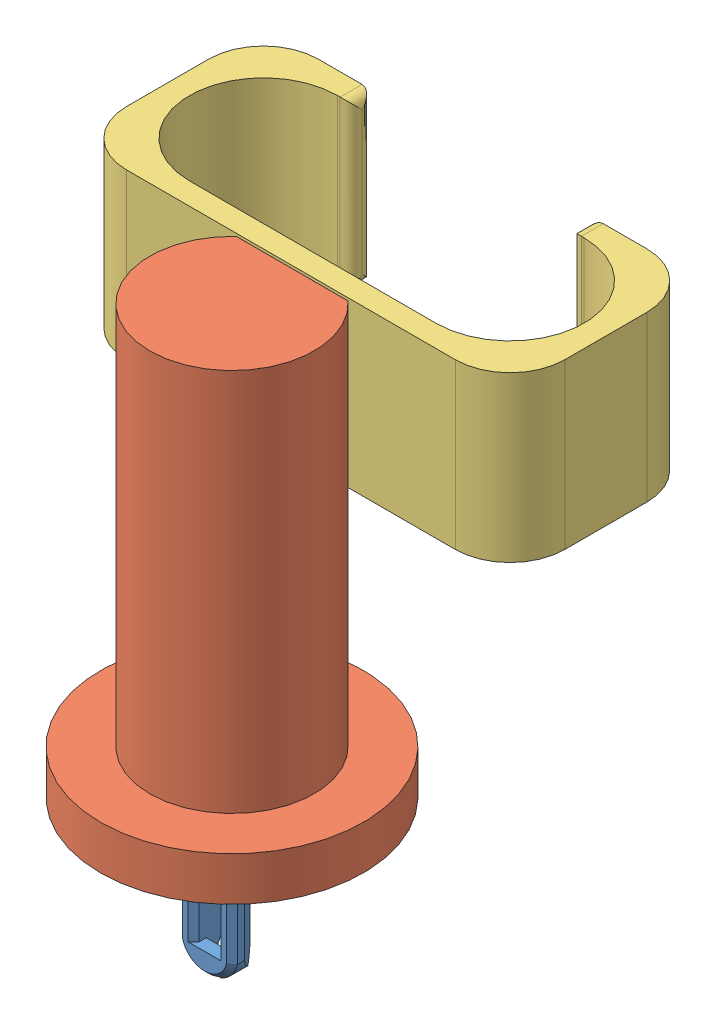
SolidWorks assembly ASSEMBLY GUIDE.SLDASM, configuration Default (file format 8000). Lengths in mm.
Overall size (80 104.15 70).
3 component instances, 3 part files, 6 mates.
Components (placement in the parent):
- connection-1: connection.SLDPRT [Default] at (-21.4943 -36.9045 107.6151) x (0 1 0) z (-1 0 0) size (30.65 10 10)
- guide support-1: guide support.SLDPRT [Default] at (-16.4943 -6.9045 102.6151) x (1 0 0) z (0 0 -1) size (48 78 48)
- guide grip small-1: guide grip small.SLDPRT [Default] at (-16.7443 33.5955 91.6151) size (80 30 46.5)
Mates (geometry in assembly coordinates):
- Coincident17: coincident aligned: plane of connection-1 through (-21.4943 -14.9045 107.6151) normal (0 -1 0); plane of guide support-1 through (-16.4943 -14.9045 102.6151) normal (0 -1 0)
- Coincident18: coincident anti-aligned: line of connection-1 through (-21.4943 -14.9045 97.6151) axis (0 0 1); line of guide support-1 through (-21.4943 -14.9045 107.6151) axis (0 0 -1)
- Coincident19: coincident anti-aligned: line of connection-1 through (-11.4943 -14.9045 97.6151) axis (-1 0 0); line of guide support-1 through (-21.4943 -14.9045 97.6151) axis (1 0 0)
- Coincident20: coincident: plane of guide support-1 through (-26.6924 33.0955 91.6151) normal (0 0 -1); plane of guide grip small-1 through (-56.7443 63.5955 91.6151) normal (0 0 1)
- Coincident21: coincident: line of guide support-1 through (-22.4943 45.0955 91.6151) axis (1 0 0); line of guide grip small-1 through (-10.9943 45.0955 91.6151) axis (-1 0 0)
- Coincident22: coincident anti-aligned: line of guide support-1 through (-22.4943 33.0955 91.6151) axis (0 1 0); line of guide grip small-1 through (-22.4943 45.0955 91.6151) axis (0 -1 0)
